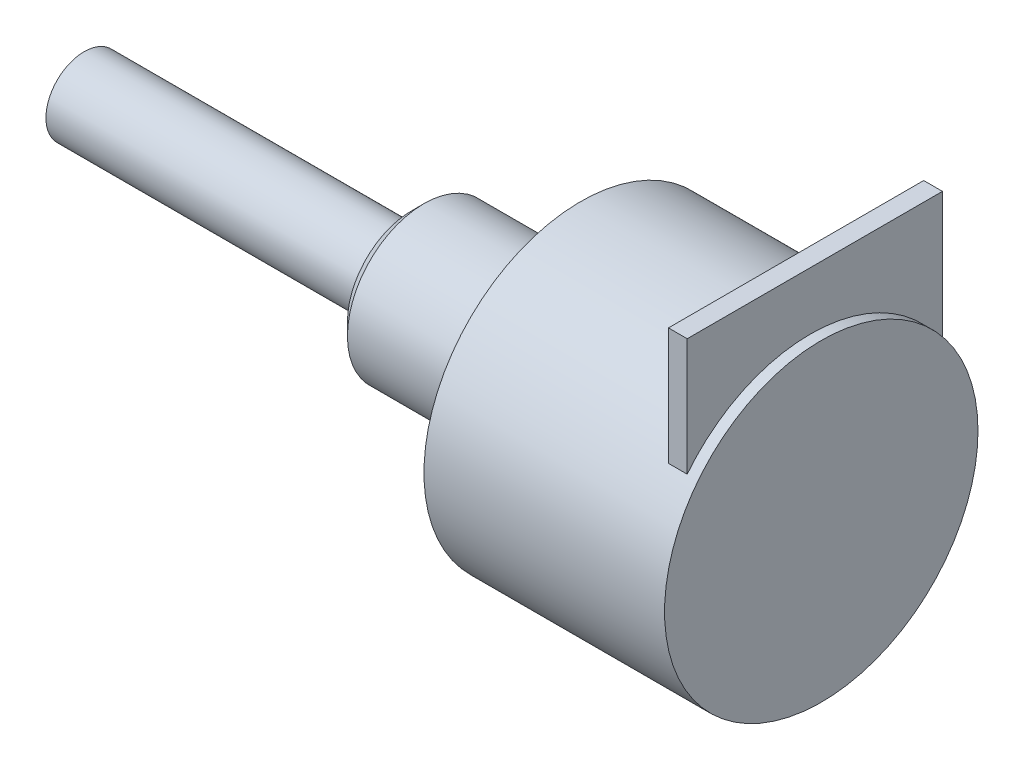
ISO-10303-21;
HEADER;
FILE_DESCRIPTION(('STEP AP214'),'2;1');
FILE_NAME('part.step','',(''),(''),'','','');
FILE_SCHEMA(('AUTOMOTIVE_DESIGN { 1 0 10303 214 1 1 1 1 }'));
ENDSEC;
DATA;
#1=APPLICATION_CONTEXT('core data for automotive mechanical design processes');
#2=APPLICATION_PROTOCOL_DEFINITION('international standard','automotive_design',2000,#1);
#3=PRODUCT_CONTEXT('',#1,'mechanical');
#4=PRODUCT('Part','Part','',(#3));
#5=PRODUCT_RELATED_PRODUCT_CATEGORY('part','',(#4));
#6=PRODUCT_DEFINITION_FORMATION('','',#4);
#7=PRODUCT_DEFINITION_CONTEXT('part definition',#1,'design');
#8=PRODUCT_DEFINITION('design','',#6,#7);
#9=PRODUCT_DEFINITION_SHAPE('','',#8);
#10=(LENGTH_UNIT() NAMED_UNIT(*) SI_UNIT(.MILLI.,.METRE.));
#11=(NAMED_UNIT(*) PLANE_ANGLE_UNIT() SI_UNIT($,.RADIAN.));
#12=(NAMED_UNIT(*) SI_UNIT($,.STERADIAN.) SOLID_ANGLE_UNIT());
#13=UNCERTAINTY_MEASURE_WITH_UNIT(LENGTH_MEASURE(1.E-05),#10,'distance_accuracy_value','');
#14=(GEOMETRIC_REPRESENTATION_CONTEXT(3) GLOBAL_UNCERTAINTY_ASSIGNED_CONTEXT((#13)) GLOBAL_UNIT_ASSIGNED_CONTEXT((#10,
#11,#12)) REPRESENTATION_CONTEXT('',''));
#15=CARTESIAN_POINT('',(0.,0.,0.));
#16=DIRECTION('',(0.,0.,1.));
#17=DIRECTION('',(1.,0.,0.));
#18=AXIS2_PLACEMENT_3D('',#15,#16,#17);
#19=CARTESIAN_POINT('',(0.,0.,0.));
#20=DIRECTION('',(1.,0.,0.));
#21=DIRECTION('',(0.,0.,-1.));
#22=AXIS2_PLACEMENT_3D('',#19,#20,#21);
#23=CYLINDRICAL_SURFACE('',#22,6.5024);
#24=CARTESIAN_POINT('',(0.,0.,0.));
#25=DIRECTION('',(1.,0.,0.));
#26=DIRECTION('',(0.,0.,-1.));
#27=AXIS2_PLACEMENT_3D('',#24,#25,#26);
#28=CIRCLE('',#27,6.5024);
#29=CARTESIAN_POINT('',(0.,0.,-6.5024));
#30=VERTEX_POINT('',#29);
#31=EDGE_CURVE('E106',#30,#30,#28,.T.);
#32=ORIENTED_EDGE('',*,*,#31,.F.);
#33=EDGE_LOOP('',(#32));
#34=FACE_BOUND('',#33,.T.);
#35=CARTESIAN_POINT('',(-9.9822,0.,0.));
#36=DIRECTION('',(1.,0.,0.));
#37=DIRECTION('',(0.,0.,-1.));
#38=AXIS2_PLACEMENT_3D('',#35,#36,#37);
#39=CIRCLE('',#38,6.5024);
#40=CARTESIAN_POINT('',(-9.9822,0.,-6.5024));
#41=VERTEX_POINT('',#40);
#42=EDGE_CURVE('E103',#41,#41,#39,.T.);
#43=ORIENTED_EDGE('',*,*,#42,.T.);
#44=EDGE_LOOP('',(#43));
#45=FACE_BOUND('',#44,.T.);
#46=DIRECTION('',(1.,0.,0.));
#47=VECTOR('',#46,1.);
#48=CARTESIAN_POINT('',(0.,4.02200558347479,5.10927361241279));
#49=LINE('',#48,#47);
#50=CARTESIAN_POINT('',(-0.453604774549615,4.02200558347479,5.10927361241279));
#51=VERTEX_POINT('',#50);
#52=CARTESIAN_POINT('',(-1.23183850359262,4.02200558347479,5.10927361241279));
#53=VERTEX_POINT('',#52);
#54=EDGE_CURVE('E115',#51,#53,#49,.F.);
#55=ORIENTED_EDGE('',*,*,#54,.T.);
#56=CARTESIAN_POINT('',(-1.23183850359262,0.,0.));
#57=DIRECTION('',(1.,0.,0.));
#58=DIRECTION('',(0.,0.,-1.));
#59=AXIS2_PLACEMENT_3D('',#56,#57,#58);
#60=CIRCLE('',#59,6.5024);
#61=CARTESIAN_POINT('',(-1.23183850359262,3.49780882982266,-5.48147235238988));
#62=VERTEX_POINT('',#61);
#63=EDGE_CURVE('E52',#53,#62,#60,.F.);
#64=ORIENTED_EDGE('',*,*,#63,.T.);
#65=DIRECTION('',(1.,0.,0.));
#66=VECTOR('',#65,1.);
#67=CARTESIAN_POINT('',(0.,3.49780882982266,-5.48147235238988));
#68=LINE('',#67,#66);
#69=CARTESIAN_POINT('',(-0.453604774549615,3.49780882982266,-5.48147235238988));
#70=VERTEX_POINT('',#69);
#71=EDGE_CURVE('E109',#62,#70,#68,.T.);
#72=ORIENTED_EDGE('',*,*,#71,.T.);
#73=CARTESIAN_POINT('',(-0.453604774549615,0.,0.));
#74=DIRECTION('',(-1.,0.,0.));
#75=DIRECTION('',(0.,0.,1.));
#76=AXIS2_PLACEMENT_3D('',#73,#74,#75);
#77=CIRCLE('',#76,6.5024);
#78=EDGE_CURVE('E112',#70,#51,#77,.F.);
#79=ORIENTED_EDGE('',*,*,#78,.T.);
#80=EDGE_LOOP('',(#55,#64,#72,#79));
#81=FACE_BOUND('',#80,.T.);
#82=ADVANCED_FACE('F29',(#34,#45,#81),#23,.T.);
#83=CARTESIAN_POINT('',(0.,0.,0.));
#84=DIRECTION('',(1.,0.,0.));
#85=DIRECTION('',(0.,0.,-1.));
#86=AXIS2_PLACEMENT_3D('',#83,#84,#85);
#87=PLANE('',#86);
#88=ORIENTED_EDGE('',*,*,#31,.T.);
#89=EDGE_LOOP('',(#88));
#90=FACE_BOUND('',#89,.T.);
#91=ADVANCED_FACE('F31',(#90),#87,.T.);
#92=CARTESIAN_POINT('',(-9.9822,6.5024,0.));
#93=DIRECTION('',(-1.,0.,0.));
#94=DIRECTION('',(0.,0.,1.));
#95=AXIS2_PLACEMENT_3D('',#92,#93,#94);
#96=PLANE('',#95);
#97=CARTESIAN_POINT('',(-9.9822,0.,0.));
#98=DIRECTION('',(1.,0.,0.));
#99=DIRECTION('',(0.,0.,-1.));
#100=AXIS2_PLACEMENT_3D('',#97,#98,#99);
#101=CIRCLE('',#100,3.175);
#102=CARTESIAN_POINT('',(-9.9822,0.,-3.175));
#103=VERTEX_POINT('',#102);
#104=EDGE_CURVE('E100',#103,#103,#101,.T.);
#105=ORIENTED_EDGE('',*,*,#104,.T.);
#106=EDGE_LOOP('',(#105));
#107=FACE_BOUND('',#106,.T.);
#108=ORIENTED_EDGE('',*,*,#42,.F.);
#109=EDGE_LOOP('',(#108));
#110=FACE_BOUND('',#109,.T.);
#111=ADVANCED_FACE('F141',(#107,#110),#96,.T.);
#112=CARTESIAN_POINT('',(0.,0.,0.));
#113=DIRECTION('',(1.,0.,0.));
#114=DIRECTION('',(0.,0.,-1.));
#115=AXIS2_PLACEMENT_3D('',#112,#113,#114);
#116=CYLINDRICAL_SURFACE('',#115,3.175);
#117=CARTESIAN_POINT('',(-16.4846,0.,0.));
#118=DIRECTION('',(-1.,0.,0.));
#119=DIRECTION('',(0.,0.,1.));
#120=AXIS2_PLACEMENT_3D('',#117,#118,#119);
#121=CIRCLE('',#120,3.175);
#122=CARTESIAN_POINT('',(-16.4846,0.,3.175));
#123=VERTEX_POINT('',#122);
#124=EDGE_CURVE('E37',#123,#123,#121,.F.);
#125=ORIENTED_EDGE('',*,*,#124,.T.);
#126=EDGE_LOOP('',(#125));
#127=FACE_BOUND('',#126,.T.);
#128=ORIENTED_EDGE('',*,*,#104,.F.);
#129=EDGE_LOOP('',(#128));
#130=FACE_BOUND('',#129,.T.);
#131=ADVANCED_FACE('F120',(#127,#130),#116,.T.);
#132=CARTESIAN_POINT('',(-16.9926,3.175,0.));
#133=DIRECTION('',(-1.,0.,0.));
#134=DIRECTION('',(0.,0.,1.));
#135=AXIS2_PLACEMENT_3D('',#132,#133,#134);
#136=PLANE('',#135);
#137=CARTESIAN_POINT('',(-16.9926,0.,0.));
#138=DIRECTION('',(-1.,0.,0.));
#139=DIRECTION('',(0.,0.,1.));
#140=AXIS2_PLACEMENT_3D('',#137,#138,#139);
#141=CIRCLE('',#140,2.667);
#142=CARTESIAN_POINT('',(-16.9926,0.,2.667));
#143=VERTEX_POINT('',#142);
#144=EDGE_CURVE('E11',#143,#143,#141,.T.);
#145=ORIENTED_EDGE('',*,*,#144,.T.);
#146=EDGE_LOOP('',(#145));
#147=FACE_BOUND('',#146,.T.);
#148=CARTESIAN_POINT('',(-16.9926,0.,0.));
#149=DIRECTION('',(1.,0.,0.));
#150=DIRECTION('',(0.,0.,-1.));
#151=AXIS2_PLACEMENT_3D('',#148,#149,#150);
#152=CIRCLE('',#151,1.5875);
#153=CARTESIAN_POINT('',(-16.9926,0.,-1.5875));
#154=VERTEX_POINT('',#153);
#155=EDGE_CURVE('E93',#154,#154,#152,.T.);
#156=ORIENTED_EDGE('',*,*,#155,.T.);
#157=EDGE_LOOP('',(#156));
#158=FACE_BOUND('',#157,.T.);
#159=ADVANCED_FACE('F151',(#147,#158),#136,.T.);
#160=CARTESIAN_POINT('',(0.,0.,0.));
#161=DIRECTION('',(1.,0.,0.));
#162=DIRECTION('',(0.,0.,-1.));
#163=AXIS2_PLACEMENT_3D('',#160,#161,#162);
#164=CYLINDRICAL_SURFACE('',#163,1.5875);
#165=CARTESIAN_POINT('',(-30.5816,0.,0.));
#166=DIRECTION('',(1.,0.,0.));
#167=DIRECTION('',(0.,0.,-1.));
#168=AXIS2_PLACEMENT_3D('',#165,#166,#167);
#169=CIRCLE('',#168,1.5875);
#170=CARTESIAN_POINT('',(-30.5816,0.,-1.5875));
#171=VERTEX_POINT('',#170);
#172=EDGE_CURVE('E90',#171,#171,#169,.T.);
#173=ORIENTED_EDGE('',*,*,#172,.T.);
#174=EDGE_LOOP('',(#173));
#175=FACE_BOUND('',#174,.T.);
#176=ORIENTED_EDGE('',*,*,#155,.F.);
#177=EDGE_LOOP('',(#176));
#178=FACE_BOUND('',#177,.T.);
#179=ADVANCED_FACE('F153',(#175,#178),#164,.T.);
#180=CARTESIAN_POINT('',(-30.5816,1.5875,0.));
#181=DIRECTION('',(-1.,0.,0.));
#182=DIRECTION('',(0.,0.,1.));
#183=AXIS2_PLACEMENT_3D('',#180,#181,#182);
#184=PLANE('',#183);
#185=ORIENTED_EDGE('',*,*,#172,.F.);
#186=EDGE_LOOP('',(#185));
#187=FACE_BOUND('',#186,.T.);
#188=ADVANCED_FACE('F157',(#187),#184,.T.);
#189=CARTESIAN_POINT('',(-1.23183850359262,8.89,-5.48147235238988));
#190=DIRECTION('',(1.,0.,0.));
#191=DIRECTION('',(0.,0.,-1.));
#192=AXIS2_PLACEMENT_3D('',#189,#190,#191);
#193=PLANE('',#192);
#194=ORIENTED_EDGE('',*,*,#63,.F.);
#195=DIRECTION('',(0.,-1.,0.));
#196=VECTOR('',#195,1.);
#197=CARTESIAN_POINT('',(-1.23183850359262,8.89,5.10927361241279));
#198=LINE('',#197,#196);
#199=CARTESIAN_POINT('',(-1.23183850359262,8.89,5.10927361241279));
#200=VERTEX_POINT('',#199);
#201=EDGE_CURVE('E75',#200,#53,#198,.T.);
#202=ORIENTED_EDGE('',*,*,#201,.F.);
#203=DIRECTION('',(0.,0.,1.));
#204=VECTOR('',#203,1.);
#205=CARTESIAN_POINT('',(-1.23183850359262,8.89,-5.48147235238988));
#206=LINE('',#205,#204);
#207=CARTESIAN_POINT('',(-1.23183850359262,8.89,-5.48147235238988));
#208=VERTEX_POINT('',#207);
#209=EDGE_CURVE('E82',#208,#200,#206,.T.);
#210=ORIENTED_EDGE('',*,*,#209,.F.);
#211=DIRECTION('',(0.,-1.,0.));
#212=VECTOR('',#211,1.);
#213=CARTESIAN_POINT('',(-1.23183850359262,8.89,-5.48147235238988));
#214=LINE('',#213,#212);
#215=EDGE_CURVE('E171',#208,#62,#214,.T.);
#216=ORIENTED_EDGE('',*,*,#215,.T.);
#217=EDGE_LOOP('',(#194,#202,#210,#216));
#218=FACE_BOUND('',#217,.T.);
#219=ADVANCED_FACE('F89',(#218),#193,.F.);
#220=CARTESIAN_POINT('',(-1.23183850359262,8.89,5.10927361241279));
#221=DIRECTION('',(0.,0.,-1.));
#222=DIRECTION('',(-1.,0.,0.));
#223=AXIS2_PLACEMENT_3D('',#220,#221,#222);
#224=PLANE('',#223);
#225=ORIENTED_EDGE('',*,*,#54,.F.);
#226=DIRECTION('',(0.,-1.,0.));
#227=VECTOR('',#226,1.);
#228=CARTESIAN_POINT('',(-0.453604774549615,8.89,5.10927361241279));
#229=LINE('',#228,#227);
#230=CARTESIAN_POINT('',(-0.453604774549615,8.89,5.10927361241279));
#231=VERTEX_POINT('',#230);
#232=EDGE_CURVE('E78',#231,#51,#229,.T.);
#233=ORIENTED_EDGE('',*,*,#232,.F.);
#234=DIRECTION('',(1.,0.,0.));
#235=VECTOR('',#234,1.);
#236=CARTESIAN_POINT('',(-1.23183850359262,8.89,5.10927361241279));
#237=LINE('',#236,#235);
#238=EDGE_CURVE('E72',#200,#231,#237,.T.);
#239=ORIENTED_EDGE('',*,*,#238,.F.);
#240=ORIENTED_EDGE('',*,*,#201,.T.);
#241=EDGE_LOOP('',(#225,#233,#239,#240));
#242=FACE_BOUND('',#241,.T.);
#243=ADVANCED_FACE('F74',(#242),#224,.F.);
#244=CARTESIAN_POINT('',(-0.453604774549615,8.89,-5.48147235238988));
#245=DIRECTION('',(-1.,0.,0.));
#246=DIRECTION('',(0.,0.,1.));
#247=AXIS2_PLACEMENT_3D('',#244,#245,#246);
#248=PLANE('',#247);
#249=ORIENTED_EDGE('',*,*,#78,.F.);
#250=DIRECTION('',(0.,-1.,0.));
#251=VECTOR('',#250,1.);
#252=CARTESIAN_POINT('',(-0.453604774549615,8.89,-5.48147235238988));
#253=LINE('',#252,#251);
#254=CARTESIAN_POINT('',(-0.453604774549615,8.89,-5.48147235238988));
#255=VERTEX_POINT('',#254);
#256=EDGE_CURVE('E44',#255,#70,#253,.T.);
#257=ORIENTED_EDGE('',*,*,#256,.F.);
#258=DIRECTION('',(0.,0.,-1.));
#259=VECTOR('',#258,1.);
#260=CARTESIAN_POINT('',(-0.453604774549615,8.89,-5.48147235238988));
#261=LINE('',#260,#259);
#262=EDGE_CURVE('E81',#231,#255,#261,.T.);
#263=ORIENTED_EDGE('',*,*,#262,.F.);
#264=ORIENTED_EDGE('',*,*,#232,.T.);
#265=EDGE_LOOP('',(#249,#257,#263,#264));
#266=FACE_BOUND('',#265,.T.);
#267=ADVANCED_FACE('F164',(#266),#248,.F.);
#268=CARTESIAN_POINT('',(-1.23183850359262,8.89,-5.48147235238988));
#269=DIRECTION('',(0.,0.,1.));
#270=DIRECTION('',(1.,0.,0.));
#271=AXIS2_PLACEMENT_3D('',#268,#269,#270);
#272=PLANE('',#271);
#273=ORIENTED_EDGE('',*,*,#71,.F.);
#274=ORIENTED_EDGE('',*,*,#215,.F.);
#275=DIRECTION('',(-1.,0.,0.));
#276=VECTOR('',#275,1.);
#277=CARTESIAN_POINT('',(-1.23183850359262,8.89,-5.48147235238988));
#278=LINE('',#277,#276);
#279=EDGE_CURVE('E86',#255,#208,#278,.T.);
#280=ORIENTED_EDGE('',*,*,#279,.F.);
#281=ORIENTED_EDGE('',*,*,#256,.T.);
#282=EDGE_LOOP('',(#273,#274,#280,#281));
#283=FACE_BOUND('',#282,.T.);
#284=ADVANCED_FACE('F131',(#283),#272,.F.);
#285=CARTESIAN_POINT('',(-1.23183850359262,8.89,5.10927361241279));
#286=DIRECTION('',(0.,1.,0.));
#287=DIRECTION('',(0.,0.,1.));
#288=AXIS2_PLACEMENT_3D('',#285,#286,#287);
#289=PLANE('',#288);
#290=ORIENTED_EDGE('',*,*,#209,.T.);
#291=ORIENTED_EDGE('',*,*,#238,.T.);
#292=ORIENTED_EDGE('',*,*,#262,.T.);
#293=ORIENTED_EDGE('',*,*,#279,.T.);
#294=EDGE_LOOP('',(#290,#291,#292,#293));
#295=FACE_BOUND('',#294,.T.);
#296=ADVANCED_FACE('F85',(#295),#289,.T.);
#297=CARTESIAN_POINT('',(-16.4846,0.,0.));
#298=DIRECTION('',(1.,0.,0.));
#299=DIRECTION('',(0.,0.,-1.));
#300=AXIS2_PLACEMENT_3D('',#297,#298,#299);
#301=CONICAL_SURFACE('',#300,3.175,0.785398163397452);
#302=ORIENTED_EDGE('',*,*,#144,.F.);
#303=EDGE_LOOP('',(#302));
#304=FACE_BOUND('',#303,.T.);
#305=ORIENTED_EDGE('',*,*,#124,.F.);
#306=EDGE_LOOP('',(#305));
#307=FACE_BOUND('',#306,.T.);
#308=ADVANCED_FACE('F123',(#304,#307),#301,.T.);
#309=CLOSED_SHELL('',(#82,#91,#111,#131,#159,#179,#188,#219,#243,#267,#284,#296,#308));
#310=MANIFOLD_SOLID_BREP('B2',#309);
#311=ADVANCED_BREP_SHAPE_REPRESENTATION('',(#18,#310),#14);
#312=SHAPE_DEFINITION_REPRESENTATION(#9,#311);
ENDSEC;
END-ISO-10303-21;
